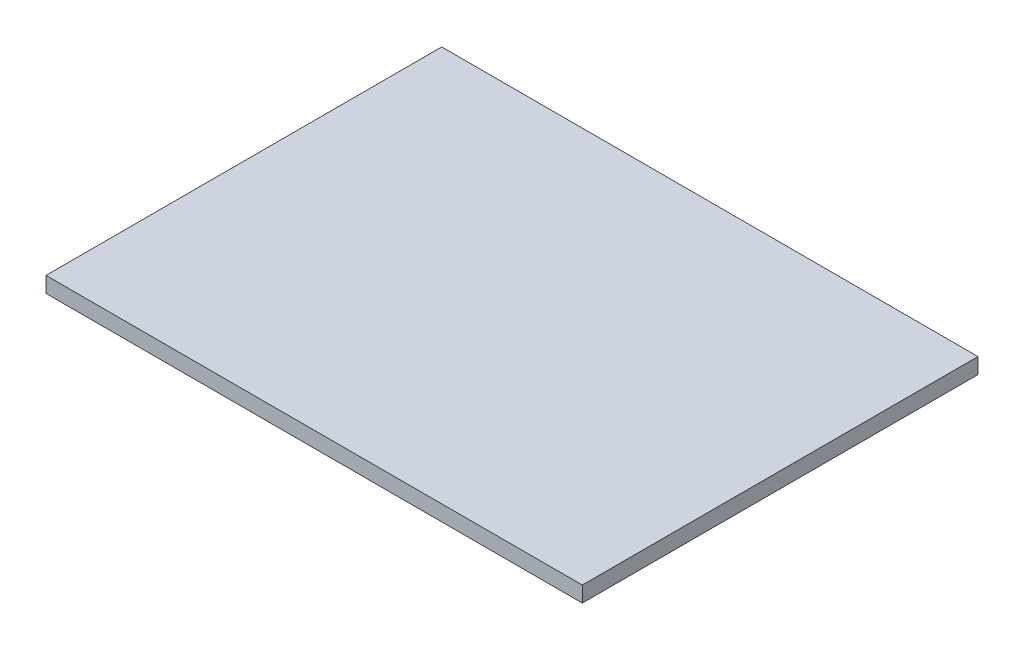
from build123d import *

# Parameters (mm, degrees)
SKETCH1_W           = 654.05
SKETCH1_H           = 482.6
BOSS_EXTRUDE1_DEPTH = 9.525


with BuildPart() as part:
    # Sketch1 → Boss-Extrude1 (new, symmetric)
    with BuildSketch(Plane(origin=(0, 0, 0), x_dir=(1, 0, 0), z_dir=(0, 1, 0))):
        Rectangle(SKETCH1_W, SKETCH1_H)
    extrude(amount=BOSS_EXTRUDE1_DEPTH, both=True)


solid = part.part
